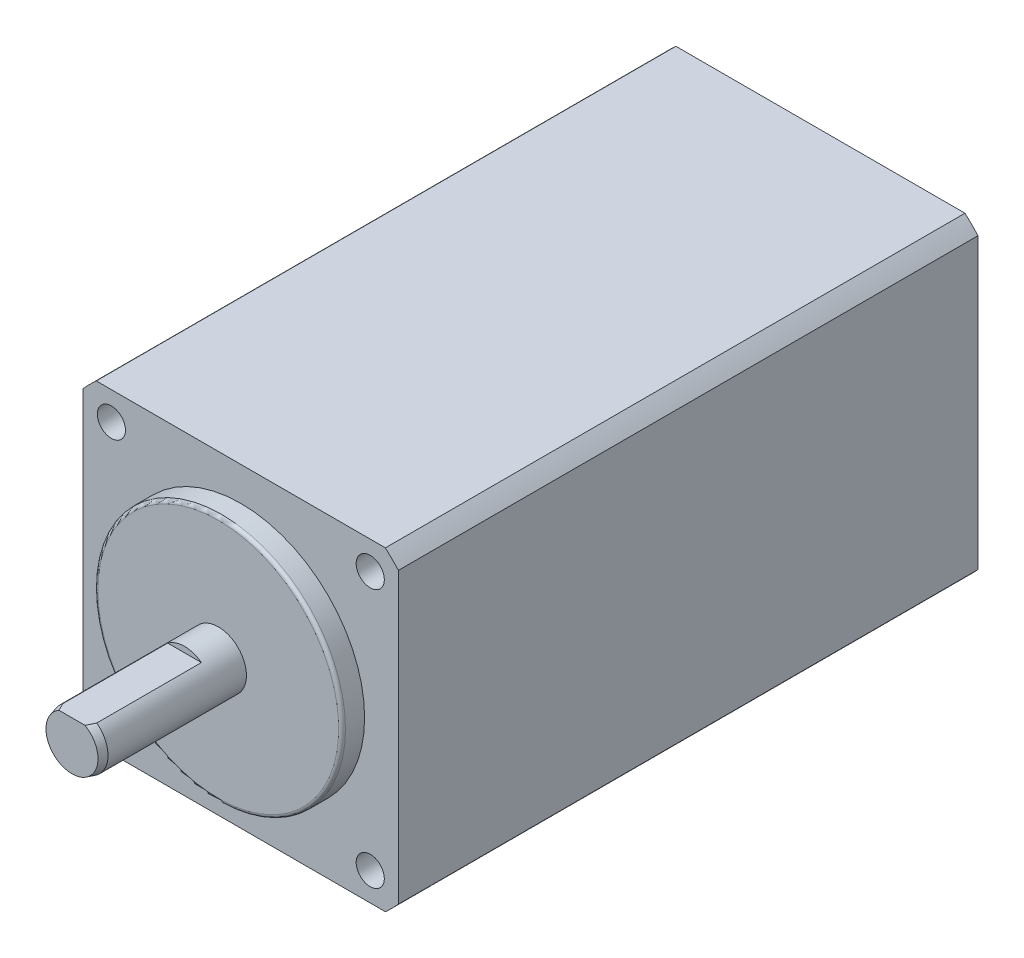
ISO-10303-21;
HEADER;
FILE_DESCRIPTION(('STEP AP214'),'2;1');
FILE_NAME('part.step','',(''),(''),'','','');
FILE_SCHEMA(('AUTOMOTIVE_DESIGN { 1 0 10303 214 1 1 1 1 }'));
ENDSEC;
DATA;
#1=APPLICATION_CONTEXT('core data for automotive mechanical design processes');
#2=APPLICATION_PROTOCOL_DEFINITION('international standard','automotive_design',2000,#1);
#3=PRODUCT_CONTEXT('',#1,'mechanical');
#4=PRODUCT('Part','Part','',(#3));
#5=PRODUCT_RELATED_PRODUCT_CATEGORY('part','',(#4));
#6=PRODUCT_DEFINITION_FORMATION('','',#4);
#7=PRODUCT_DEFINITION_CONTEXT('part definition',#1,'design');
#8=PRODUCT_DEFINITION('design','',#6,#7);
#9=PRODUCT_DEFINITION_SHAPE('','',#8);
#10=(LENGTH_UNIT() NAMED_UNIT(*) SI_UNIT(.MILLI.,.METRE.));
#11=(NAMED_UNIT(*) PLANE_ANGLE_UNIT() SI_UNIT($,.RADIAN.));
#12=(NAMED_UNIT(*) SI_UNIT($,.STERADIAN.) SOLID_ANGLE_UNIT());
#13=UNCERTAINTY_MEASURE_WITH_UNIT(LENGTH_MEASURE(1.E-05),#10,'distance_accuracy_value','');
#14=(GEOMETRIC_REPRESENTATION_CONTEXT(3) GLOBAL_UNCERTAINTY_ASSIGNED_CONTEXT((#13)) GLOBAL_UNIT_ASSIGNED_CONTEXT((#10,
#11,#12)) REPRESENTATION_CONTEXT('',''));
#15=CARTESIAN_POINT('',(0.,0.,0.));
#16=DIRECTION('',(0.,0.,1.));
#17=DIRECTION('',(1.,0.,0.));
#18=AXIS2_PLACEMENT_3D('',#15,#16,#17);
#19=CARTESIAN_POINT('',(-14.,0.,-51.5));
#20=DIRECTION('',(1.,0.,0.));
#21=DIRECTION('',(0.,0.,-1.));
#22=AXIS2_PLACEMENT_3D('',#19,#20,#21);
#23=PLANE('',#22);
#24=DIRECTION('',(0.,1.,0.));
#25=VECTOR('',#24,1.);
#26=CARTESIAN_POINT('',(-14.,0.,0.));
#27=LINE('',#26,#25);
#28=CARTESIAN_POINT('',(-14.,-12.8452325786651,0.));
#29=VERTEX_POINT('',#28);
#30=CARTESIAN_POINT('',(-14.,12.8452325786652,0.));
#31=VERTEX_POINT('',#30);
#32=EDGE_CURVE('E317',#29,#31,#27,.T.);
#33=ORIENTED_EDGE('',*,*,#32,.T.);
#34=DIRECTION('',(0.,0.,1.));
#35=VECTOR('',#34,1.);
#36=CARTESIAN_POINT('',(-14.,12.8452325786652,-51.5));
#37=LINE('',#36,#35);
#38=CARTESIAN_POINT('',(-14.,12.8452325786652,-51.5));
#39=VERTEX_POINT('',#38);
#40=EDGE_CURVE('E221',#39,#31,#37,.T.);
#41=ORIENTED_EDGE('',*,*,#40,.F.);
#42=DIRECTION('',(0.,1.,0.));
#43=VECTOR('',#42,1.);
#44=CARTESIAN_POINT('',(-14.,0.,-51.5));
#45=LINE('',#44,#43);
#46=CARTESIAN_POINT('',(-14.,-12.8452325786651,-51.5));
#47=VERTEX_POINT('',#46);
#48=EDGE_CURVE('E384',#47,#39,#45,.T.);
#49=ORIENTED_EDGE('',*,*,#48,.F.);
#50=DIRECTION('',(0.,0.,1.));
#51=VECTOR('',#50,1.);
#52=CARTESIAN_POINT('',(-14.,-12.8452325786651,-51.5));
#53=LINE('',#52,#51);
#54=EDGE_CURVE('E321',#47,#29,#53,.T.);
#55=ORIENTED_EDGE('',*,*,#54,.T.);
#56=EDGE_LOOP('',(#33,#41,#49,#55));
#57=FACE_BOUND('',#56,.T.);
#58=ADVANCED_FACE('F49',(#57),#23,.F.);
#59=CARTESIAN_POINT('',(0.,0.,-51.5));
#60=DIRECTION('',(0.,0.,1.));
#61=DIRECTION('',(1.,0.,0.));
#62=AXIS2_PLACEMENT_3D('',#59,#60,#61);
#63=CYLINDRICAL_SURFACE('',#62,19.);
#64=CARTESIAN_POINT('',(0.,0.,0.));
#65=DIRECTION('',(0.,0.,-1.));
#66=DIRECTION('',(-1.,0.,0.));
#67=AXIS2_PLACEMENT_3D('',#64,#65,#66);
#68=CIRCLE('',#67,19.);
#69=CARTESIAN_POINT('',(-12.8452325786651,14.,0.));
#70=VERTEX_POINT('',#69);
#71=EDGE_CURVE('E324',#31,#70,#68,.T.);
#72=ORIENTED_EDGE('',*,*,#71,.T.);
#73=DIRECTION('',(0.,0.,1.));
#74=VECTOR('',#73,1.);
#75=CARTESIAN_POINT('',(-12.8452325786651,14.,-51.5));
#76=LINE('',#75,#74);
#77=CARTESIAN_POINT('',(-12.8452325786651,14.,-51.5));
#78=VERTEX_POINT('',#77);
#79=EDGE_CURVE('E358',#78,#70,#76,.T.);
#80=ORIENTED_EDGE('',*,*,#79,.F.);
#81=CARTESIAN_POINT('',(0.,0.,-51.5));
#82=DIRECTION('',(0.,0.,-1.));
#83=DIRECTION('',(-1.,0.,0.));
#84=AXIS2_PLACEMENT_3D('',#81,#82,#83);
#85=CIRCLE('',#84,19.);
#86=EDGE_CURVE('E387',#39,#78,#85,.T.);
#87=ORIENTED_EDGE('',*,*,#86,.F.);
#88=ORIENTED_EDGE('',*,*,#40,.T.);
#89=EDGE_LOOP('',(#72,#80,#87,#88));
#90=FACE_BOUND('',#89,.T.);
#91=ADVANCED_FACE('F294',(#90),#63,.T.);
#92=CARTESIAN_POINT('',(0.,14.,-51.5));
#93=DIRECTION('',(0.,-1.,0.));
#94=DIRECTION('',(0.,0.,-1.));
#95=AXIS2_PLACEMENT_3D('',#92,#93,#94);
#96=PLANE('',#95);
#97=DIRECTION('',(1.,0.,0.));
#98=VECTOR('',#97,1.);
#99=CARTESIAN_POINT('',(0.,14.,0.));
#100=LINE('',#99,#98);
#101=CARTESIAN_POINT('',(12.8452325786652,14.,0.));
#102=VERTEX_POINT('',#101);
#103=EDGE_CURVE('E327',#70,#102,#100,.T.);
#104=ORIENTED_EDGE('',*,*,#103,.T.);
#105=DIRECTION('',(0.,0.,1.));
#106=VECTOR('',#105,1.);
#107=CARTESIAN_POINT('',(12.8452325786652,14.,-51.5));
#108=LINE('',#107,#106);
#109=CARTESIAN_POINT('',(12.8452325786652,14.,-51.5));
#110=VERTEX_POINT('',#109);
#111=EDGE_CURVE('E355',#110,#102,#108,.T.);
#112=ORIENTED_EDGE('',*,*,#111,.F.);
#113=DIRECTION('',(1.,0.,0.));
#114=VECTOR('',#113,1.);
#115=CARTESIAN_POINT('',(0.,14.,-51.5));
#116=LINE('',#115,#114);
#117=EDGE_CURVE('E389',#78,#110,#116,.T.);
#118=ORIENTED_EDGE('',*,*,#117,.F.);
#119=ORIENTED_EDGE('',*,*,#79,.T.);
#120=EDGE_LOOP('',(#104,#112,#118,#119));
#121=FACE_BOUND('',#120,.T.);
#122=ADVANCED_FACE('F304',(#121),#96,.F.);
#123=CARTESIAN_POINT('',(14.,12.8452325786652,0.));
#124=VERTEX_POINT('',#123);
#125=EDGE_CURVE('E330',#102,#124,#68,.T.);
#126=ORIENTED_EDGE('',*,*,#125,.T.);
#127=DIRECTION('',(0.,0.,1.));
#128=VECTOR('',#127,1.);
#129=CARTESIAN_POINT('',(14.,12.8452325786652,-51.5));
#130=LINE('',#129,#128);
#131=CARTESIAN_POINT('',(14.,12.8452325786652,-51.5));
#132=VERTEX_POINT('',#131);
#133=EDGE_CURVE('E353',#132,#124,#130,.T.);
#134=ORIENTED_EDGE('',*,*,#133,.F.);
#135=EDGE_CURVE('E390',#110,#132,#85,.T.);
#136=ORIENTED_EDGE('',*,*,#135,.F.);
#137=ORIENTED_EDGE('',*,*,#111,.T.);
#138=EDGE_LOOP('',(#126,#134,#136,#137));
#139=FACE_BOUND('',#138,.T.);
#140=ADVANCED_FACE('F302',(#139),#63,.T.);
#141=CARTESIAN_POINT('',(14.,0.,-51.5));
#142=DIRECTION('',(1.,0.,0.));
#143=DIRECTION('',(0.,0.,-1.));
#144=AXIS2_PLACEMENT_3D('',#141,#142,#143);
#145=PLANE('',#144);
#146=DIRECTION('',(0.,1.,0.));
#147=VECTOR('',#146,1.);
#148=CARTESIAN_POINT('',(14.,0.,0.));
#149=LINE('',#148,#147);
#150=CARTESIAN_POINT('',(14.,-12.8452325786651,0.));
#151=VERTEX_POINT('',#150);
#152=EDGE_CURVE('E338',#151,#124,#149,.T.);
#153=ORIENTED_EDGE('',*,*,#152,.F.);
#154=DIRECTION('',(0.,0.,1.));
#155=VECTOR('',#154,1.);
#156=CARTESIAN_POINT('',(14.,-12.8452325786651,-51.5));
#157=LINE('',#156,#155);
#158=CARTESIAN_POINT('',(14.,-12.8452325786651,-51.5));
#159=VERTEX_POINT('',#158);
#160=EDGE_CURVE('E351',#159,#151,#157,.T.);
#161=ORIENTED_EDGE('',*,*,#160,.F.);
#162=DIRECTION('',(0.,1.,0.));
#163=VECTOR('',#162,1.);
#164=CARTESIAN_POINT('',(14.,0.,-51.5));
#165=LINE('',#164,#163);
#166=EDGE_CURVE('E391',#159,#132,#165,.T.);
#167=ORIENTED_EDGE('',*,*,#166,.T.);
#168=ORIENTED_EDGE('',*,*,#133,.T.);
#169=EDGE_LOOP('',(#153,#161,#167,#168));
#170=FACE_BOUND('',#169,.T.);
#171=ADVANCED_FACE('F299',(#170),#145,.T.);
#172=CARTESIAN_POINT('',(12.8452325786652,-14.,0.));
#173=VERTEX_POINT('',#172);
#174=EDGE_CURVE('E341',#151,#173,#68,.T.);
#175=ORIENTED_EDGE('',*,*,#174,.T.);
#176=DIRECTION('',(0.,0.,1.));
#177=VECTOR('',#176,1.);
#178=CARTESIAN_POINT('',(12.8452325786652,-14.,-51.5));
#179=LINE('',#178,#177);
#180=CARTESIAN_POINT('',(12.8452325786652,-14.,-51.5));
#181=VERTEX_POINT('',#180);
#182=EDGE_CURVE('E349',#181,#173,#179,.T.);
#183=ORIENTED_EDGE('',*,*,#182,.F.);
#184=EDGE_CURVE('E366',#159,#181,#85,.T.);
#185=ORIENTED_EDGE('',*,*,#184,.F.);
#186=ORIENTED_EDGE('',*,*,#160,.T.);
#187=EDGE_LOOP('',(#175,#183,#185,#186));
#188=FACE_BOUND('',#187,.T.);
#189=ADVANCED_FACE('F295',(#188),#63,.T.);
#190=CARTESIAN_POINT('',(0.,-14.,-51.5));
#191=DIRECTION('',(0.,-1.,0.));
#192=DIRECTION('',(0.,0.,-1.));
#193=AXIS2_PLACEMENT_3D('',#190,#191,#192);
#194=PLANE('',#193);
#195=DIRECTION('',(0.,0.,-1.));
#196=VECTOR('',#195,1.);
#197=CARTESIAN_POINT('',(-7.6,-14.,-51.5));
#198=LINE('',#197,#196);
#199=CARTESIAN_POINT('',(-7.6,-14.,-42.));
#200=VERTEX_POINT('',#199);
#201=CARTESIAN_POINT('',(-7.6,-14.,-51.5));
#202=VERTEX_POINT('',#201);
#203=EDGE_CURVE('E193',#200,#202,#198,.T.);
#204=ORIENTED_EDGE('',*,*,#203,.F.);
#205=DIRECTION('',(-1.,0.,0.));
#206=VECTOR('',#205,1.);
#207=CARTESIAN_POINT('',(-7.6,-14.,-42.));
#208=LINE('',#207,#206);
#209=CARTESIAN_POINT('',(7.6,-14.,-42.));
#210=VERTEX_POINT('',#209);
#211=EDGE_CURVE('E200',#210,#200,#208,.T.);
#212=ORIENTED_EDGE('',*,*,#211,.F.);
#213=DIRECTION('',(0.,0.,1.));
#214=VECTOR('',#213,1.);
#215=CARTESIAN_POINT('',(7.6,-14.,-51.5));
#216=LINE('',#215,#214);
#217=CARTESIAN_POINT('',(7.6,-14.,-51.5));
#218=VERTEX_POINT('',#217);
#219=EDGE_CURVE('E214',#218,#210,#216,.T.);
#220=ORIENTED_EDGE('',*,*,#219,.F.);
#221=DIRECTION('',(1.,0.,0.));
#222=VECTOR('',#221,1.);
#223=CARTESIAN_POINT('',(0.,-14.,-51.5));
#224=LINE('',#223,#222);
#225=EDGE_CURVE('E364',#218,#181,#224,.T.);
#226=ORIENTED_EDGE('',*,*,#225,.T.);
#227=ORIENTED_EDGE('',*,*,#182,.T.);
#228=DIRECTION('',(1.,0.,0.));
#229=VECTOR('',#228,1.);
#230=CARTESIAN_POINT('',(0.,-14.,0.));
#231=LINE('',#230,#229);
#232=CARTESIAN_POINT('',(-12.8452325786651,-14.,0.));
#233=VERTEX_POINT('',#232);
#234=EDGE_CURVE('E342',#233,#173,#231,.T.);
#235=ORIENTED_EDGE('',*,*,#234,.F.);
#236=DIRECTION('',(0.,0.,1.));
#237=VECTOR('',#236,1.);
#238=CARTESIAN_POINT('',(-12.8452325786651,-14.,-51.5));
#239=LINE('',#238,#237);
#240=CARTESIAN_POINT('',(-12.8452325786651,-14.,-51.5));
#241=VERTEX_POINT('',#240);
#242=EDGE_CURVE('E346',#241,#233,#239,.T.);
#243=ORIENTED_EDGE('',*,*,#242,.F.);
#244=EDGE_CURVE('E362',#241,#202,#224,.T.);
#245=ORIENTED_EDGE('',*,*,#244,.T.);
#246=EDGE_LOOP('',(#204,#212,#220,#226,#227,#235,#243,#245));
#247=FACE_BOUND('',#246,.T.);
#248=ADVANCED_FACE('F292',(#247),#194,.T.);
#249=EDGE_CURVE('E329',#233,#29,#68,.T.);
#250=ORIENTED_EDGE('',*,*,#249,.T.);
#251=ORIENTED_EDGE('',*,*,#54,.F.);
#252=EDGE_CURVE('E347',#241,#47,#85,.T.);
#253=ORIENTED_EDGE('',*,*,#252,.F.);
#254=ORIENTED_EDGE('',*,*,#242,.T.);
#255=EDGE_LOOP('',(#250,#251,#253,#254));
#256=FACE_BOUND('',#255,.T.);
#257=ADVANCED_FACE('F286',(#256),#63,.T.);
#258=CARTESIAN_POINT('',(0.,0.,-51.5));
#259=DIRECTION('',(0.,0.,-1.));
#260=DIRECTION('',(-1.,0.,0.));
#261=AXIS2_PLACEMENT_3D('',#258,#259,#260);
#262=PLANE('',#261);
#263=DIRECTION('',(-1.,0.,0.));
#264=VECTOR('',#263,1.);
#265=CARTESIAN_POINT('',(0.,2.,-51.5));
#266=LINE('',#265,#264);
#267=CARTESIAN_POINT('',(1.5,2.,-51.5));
#268=VERTEX_POINT('',#267);
#269=CARTESIAN_POINT('',(-1.5,2.,-51.5));
#270=VERTEX_POINT('',#269);
#271=EDGE_CURVE('E156',#268,#270,#266,.T.);
#272=ORIENTED_EDGE('',*,*,#271,.T.);
#273=CARTESIAN_POINT('',(0.,0.,-51.5));
#274=DIRECTION('',(0.,0.,-1.));
#275=DIRECTION('',(-1.,0.,0.));
#276=AXIS2_PLACEMENT_3D('',#273,#274,#275);
#277=CIRCLE('',#276,2.5);
#278=EDGE_CURVE('E161',#268,#270,#277,.T.);
#279=ORIENTED_EDGE('',*,*,#278,.F.);
#280=EDGE_LOOP('',(#272,#279));
#281=FACE_BOUND('',#280,.T.);
#282=ORIENTED_EDGE('',*,*,#48,.T.);
#283=ORIENTED_EDGE('',*,*,#86,.T.);
#284=ORIENTED_EDGE('',*,*,#117,.T.);
#285=ORIENTED_EDGE('',*,*,#135,.T.);
#286=ORIENTED_EDGE('',*,*,#166,.F.);
#287=ORIENTED_EDGE('',*,*,#184,.T.);
#288=ORIENTED_EDGE('',*,*,#225,.F.);
#289=DIRECTION('',(0.,1.,0.));
#290=VECTOR('',#289,1.);
#291=CARTESIAN_POINT('',(7.6,-19.,-51.5));
#292=LINE('',#291,#290);
#293=CARTESIAN_POINT('',(7.6,-19.,-51.5));
#294=VERTEX_POINT('',#293);
#295=EDGE_CURVE('E332',#294,#218,#292,.T.);
#296=ORIENTED_EDGE('',*,*,#295,.F.);
#297=DIRECTION('',(1.,0.,0.));
#298=VECTOR('',#297,1.);
#299=CARTESIAN_POINT('',(-7.6,-19.,-51.5));
#300=LINE('',#299,#298);
#301=CARTESIAN_POINT('',(-7.6,-19.,-51.5));
#302=VERTEX_POINT('',#301);
#303=EDGE_CURVE('E199',#302,#294,#300,.T.);
#304=ORIENTED_EDGE('',*,*,#303,.F.);
#305=DIRECTION('',(0.,1.,0.));
#306=VECTOR('',#305,1.);
#307=CARTESIAN_POINT('',(-7.6,-19.,-51.5));
#308=LINE('',#307,#306);
#309=EDGE_CURVE('E325',#302,#202,#308,.T.);
#310=ORIENTED_EDGE('',*,*,#309,.T.);
#311=ORIENTED_EDGE('',*,*,#244,.F.);
#312=ORIENTED_EDGE('',*,*,#252,.T.);
#313=EDGE_LOOP('',(#282,#283,#284,#285,#286,#287,#288,#296,#304,#310,#311,#312));
#314=FACE_BOUND('',#313,.T.);
#315=ADVANCED_FACE('F165',(#281,#314),#262,.T.);
#316=CARTESIAN_POINT('',(0.,0.,0.));
#317=DIRECTION('',(0.,0.,-1.));
#318=DIRECTION('',(-1.,0.,0.));
#319=AXIS2_PLACEMENT_3D('',#316,#317,#318);
#320=PLANE('',#319);
#321=CARTESIAN_POINT('',(11.5,-11.5,0.));
#322=DIRECTION('',(0.,0.,1.));
#323=DIRECTION('',(1.,0.,0.));
#324=AXIS2_PLACEMENT_3D('',#321,#322,#323);
#325=CIRCLE('',#324,1.25);
#326=CARTESIAN_POINT('',(12.75,-11.5,0.));
#327=VERTEX_POINT('',#326);
#328=EDGE_CURVE('E171',#327,#327,#325,.T.);
#329=ORIENTED_EDGE('',*,*,#328,.F.);
#330=EDGE_LOOP('',(#329));
#331=FACE_BOUND('',#330,.T.);
#332=CARTESIAN_POINT('',(-11.5,-11.5,0.));
#333=DIRECTION('',(0.,0.,1.));
#334=DIRECTION('',(1.,0.,0.));
#335=AXIS2_PLACEMENT_3D('',#332,#333,#334);
#336=CIRCLE('',#335,1.25);
#337=CARTESIAN_POINT('',(-10.25,-11.5,0.));
#338=VERTEX_POINT('',#337);
#339=EDGE_CURVE('E175',#338,#338,#336,.T.);
#340=ORIENTED_EDGE('',*,*,#339,.F.);
#341=EDGE_LOOP('',(#340));
#342=FACE_BOUND('',#341,.T.);
#343=CARTESIAN_POINT('',(11.5,11.5,0.));
#344=DIRECTION('',(0.,0.,1.));
#345=DIRECTION('',(1.,0.,0.));
#346=AXIS2_PLACEMENT_3D('',#343,#344,#345);
#347=CIRCLE('',#346,1.25);
#348=CARTESIAN_POINT('',(12.75,11.5,0.));
#349=VERTEX_POINT('',#348);
#350=EDGE_CURVE('E181',#349,#349,#347,.T.);
#351=ORIENTED_EDGE('',*,*,#350,.F.);
#352=EDGE_LOOP('',(#351));
#353=FACE_BOUND('',#352,.T.);
#354=CARTESIAN_POINT('',(-11.5,11.5,0.));
#355=DIRECTION('',(0.,0.,1.));
#356=DIRECTION('',(1.,0.,0.));
#357=AXIS2_PLACEMENT_3D('',#354,#355,#356);
#358=CIRCLE('',#357,1.25);
#359=CARTESIAN_POINT('',(-10.25,11.5,0.));
#360=VERTEX_POINT('',#359);
#361=EDGE_CURVE('E187',#360,#360,#358,.T.);
#362=ORIENTED_EDGE('',*,*,#361,.F.);
#363=EDGE_LOOP('',(#362));
#364=FACE_BOUND('',#363,.T.);
#365=ORIENTED_EDGE('',*,*,#32,.F.);
#366=ORIENTED_EDGE('',*,*,#249,.F.);
#367=ORIENTED_EDGE('',*,*,#234,.T.);
#368=ORIENTED_EDGE('',*,*,#174,.F.);
#369=ORIENTED_EDGE('',*,*,#152,.T.);
#370=ORIENTED_EDGE('',*,*,#125,.F.);
#371=ORIENTED_EDGE('',*,*,#103,.F.);
#372=ORIENTED_EDGE('',*,*,#71,.F.);
#373=EDGE_LOOP('',(#365,#366,#367,#368,#369,#370,#371,#372));
#374=FACE_BOUND('',#373,.T.);
#375=ADVANCED_FACE('F282',(#331,#342,#353,#364,#374),#320,.F.);
#376=CARTESIAN_POINT('',(-7.6,-19.,-51.5));
#377=DIRECTION('',(1.,0.,0.));
#378=DIRECTION('',(0.,0.,-1.));
#379=AXIS2_PLACEMENT_3D('',#376,#377,#378);
#380=PLANE('',#379);
#381=ORIENTED_EDGE('',*,*,#203,.T.);
#382=ORIENTED_EDGE('',*,*,#309,.F.);
#383=DIRECTION('',(0.,0.,-1.));
#384=VECTOR('',#383,1.);
#385=CARTESIAN_POINT('',(-7.6,-19.,-51.5));
#386=LINE('',#385,#384);
#387=CARTESIAN_POINT('',(-7.6,-19.,-42.));
#388=VERTEX_POINT('',#387);
#389=EDGE_CURVE('E196',#388,#302,#386,.T.);
#390=ORIENTED_EDGE('',*,*,#389,.F.);
#391=DIRECTION('',(0.,1.,0.));
#392=VECTOR('',#391,1.);
#393=CARTESIAN_POINT('',(-7.6,-19.,-42.));
#394=LINE('',#393,#392);
#395=EDGE_CURVE('E206',#388,#200,#394,.T.);
#396=ORIENTED_EDGE('',*,*,#395,.T.);
#397=EDGE_LOOP('',(#381,#382,#390,#396));
#398=FACE_BOUND('',#397,.T.);
#399=ADVANCED_FACE('F278',(#398),#380,.F.);
#400=CARTESIAN_POINT('',(7.6,-19.,-51.5));
#401=DIRECTION('',(-1.,0.,0.));
#402=DIRECTION('',(0.,0.,1.));
#403=AXIS2_PLACEMENT_3D('',#400,#401,#402);
#404=PLANE('',#403);
#405=ORIENTED_EDGE('',*,*,#219,.T.);
#406=DIRECTION('',(0.,1.,0.));
#407=VECTOR('',#406,1.);
#408=CARTESIAN_POINT('',(7.6,-19.,-42.));
#409=LINE('',#408,#407);
#410=CARTESIAN_POINT('',(7.6,-19.,-42.));
#411=VERTEX_POINT('',#410);
#412=EDGE_CURVE('E373',#411,#210,#409,.T.);
#413=ORIENTED_EDGE('',*,*,#412,.F.);
#414=DIRECTION('',(0.,0.,1.));
#415=VECTOR('',#414,1.);
#416=CARTESIAN_POINT('',(7.6,-19.,-51.5));
#417=LINE('',#416,#415);
#418=EDGE_CURVE('E202',#294,#411,#417,.T.);
#419=ORIENTED_EDGE('',*,*,#418,.F.);
#420=ORIENTED_EDGE('',*,*,#295,.T.);
#421=EDGE_LOOP('',(#405,#413,#419,#420));
#422=FACE_BOUND('',#421,.T.);
#423=ADVANCED_FACE('F274',(#422),#404,.F.);
#424=CARTESIAN_POINT('',(-7.6,-19.,-42.));
#425=DIRECTION('',(0.,0.,-1.));
#426=DIRECTION('',(-1.,0.,0.));
#427=AXIS2_PLACEMENT_3D('',#424,#425,#426);
#428=PLANE('',#427);
#429=ORIENTED_EDGE('',*,*,#211,.T.);
#430=ORIENTED_EDGE('',*,*,#395,.F.);
#431=DIRECTION('',(-1.,0.,0.));
#432=VECTOR('',#431,1.);
#433=CARTESIAN_POINT('',(-7.6,-19.,-42.));
#434=LINE('',#433,#432);
#435=EDGE_CURVE('E204',#411,#388,#434,.T.);
#436=ORIENTED_EDGE('',*,*,#435,.F.);
#437=ORIENTED_EDGE('',*,*,#412,.T.);
#438=EDGE_LOOP('',(#429,#430,#436,#437));
#439=FACE_BOUND('',#438,.T.);
#440=ADVANCED_FACE('F270',(#439),#428,.F.);
#441=CARTESIAN_POINT('',(0.,-19.,0.));
#442=DIRECTION('',(0.,1.,0.));
#443=DIRECTION('',(0.,0.,1.));
#444=AXIS2_PLACEMENT_3D('',#441,#442,#443);
#445=PLANE('',#444);
#446=ORIENTED_EDGE('',*,*,#389,.T.);
#447=ORIENTED_EDGE('',*,*,#303,.T.);
#448=ORIENTED_EDGE('',*,*,#418,.T.);
#449=ORIENTED_EDGE('',*,*,#435,.T.);
#450=EDGE_LOOP('',(#446,#447,#448,#449));
#451=FACE_BOUND('',#450,.T.);
#452=ADVANCED_FACE('F266',(#451),#445,.F.);
#453=CARTESIAN_POINT('',(-11.5,11.5,-4.5));
#454=DIRECTION('',(0.,0.,1.));
#455=DIRECTION('',(1.,0.,0.));
#456=AXIS2_PLACEMENT_3D('',#453,#454,#455);
#457=CYLINDRICAL_SURFACE('',#456,1.25);
#458=CARTESIAN_POINT('',(-11.5,11.5,-4.5));
#459=DIRECTION('',(0.,0.,1.));
#460=DIRECTION('',(1.,0.,0.));
#461=AXIS2_PLACEMENT_3D('',#458,#459,#460);
#462=CIRCLE('',#461,1.25);
#463=CARTESIAN_POINT('',(-10.25,11.5,-4.5));
#464=VERTEX_POINT('',#463);
#465=EDGE_CURVE('E190',#464,#464,#462,.T.);
#466=ORIENTED_EDGE('',*,*,#465,.F.);
#467=EDGE_LOOP('',(#466));
#468=FACE_BOUND('',#467,.T.);
#469=ORIENTED_EDGE('',*,*,#361,.T.);
#470=EDGE_LOOP('',(#469));
#471=FACE_BOUND('',#470,.T.);
#472=ADVANCED_FACE('F262',(#468,#471),#457,.F.);
#473=CARTESIAN_POINT('',(-11.5,11.5,-4.5));
#474=DIRECTION('',(0.,0.,1.));
#475=DIRECTION('',(1.,0.,0.));
#476=AXIS2_PLACEMENT_3D('',#473,#474,#475);
#477=PLANE('',#476);
#478=ORIENTED_EDGE('',*,*,#465,.T.);
#479=EDGE_LOOP('',(#478));
#480=FACE_BOUND('',#479,.T.);
#481=ADVANCED_FACE('F258',(#480),#477,.T.);
#482=CARTESIAN_POINT('',(11.5,11.5,-4.5));
#483=DIRECTION('',(0.,0.,1.));
#484=DIRECTION('',(1.,0.,0.));
#485=AXIS2_PLACEMENT_3D('',#482,#483,#484);
#486=CYLINDRICAL_SURFACE('',#485,1.25);
#487=CARTESIAN_POINT('',(11.5,11.5,-4.5));
#488=DIRECTION('',(0.,0.,1.));
#489=DIRECTION('',(1.,0.,0.));
#490=AXIS2_PLACEMENT_3D('',#487,#488,#489);
#491=CIRCLE('',#490,1.25);
#492=CARTESIAN_POINT('',(12.75,11.5,-4.5));
#493=VERTEX_POINT('',#492);
#494=EDGE_CURVE('E184',#493,#493,#491,.T.);
#495=ORIENTED_EDGE('',*,*,#494,.F.);
#496=EDGE_LOOP('',(#495));
#497=FACE_BOUND('',#496,.T.);
#498=ORIENTED_EDGE('',*,*,#350,.T.);
#499=EDGE_LOOP('',(#498));
#500=FACE_BOUND('',#499,.T.);
#501=ADVANCED_FACE('F254',(#497,#500),#486,.F.);
#502=CARTESIAN_POINT('',(11.5,11.5,-4.5));
#503=DIRECTION('',(0.,0.,1.));
#504=DIRECTION('',(1.,0.,0.));
#505=AXIS2_PLACEMENT_3D('',#502,#503,#504);
#506=PLANE('',#505);
#507=ORIENTED_EDGE('',*,*,#494,.T.);
#508=EDGE_LOOP('',(#507));
#509=FACE_BOUND('',#508,.T.);
#510=ADVANCED_FACE('F250',(#509),#506,.T.);
#511=CARTESIAN_POINT('',(-11.5,-11.5,-4.5));
#512=DIRECTION('',(0.,0.,1.));
#513=DIRECTION('',(1.,0.,0.));
#514=AXIS2_PLACEMENT_3D('',#511,#512,#513);
#515=CYLINDRICAL_SURFACE('',#514,1.25);
#516=CARTESIAN_POINT('',(-11.5,-11.5,-4.5));
#517=DIRECTION('',(0.,0.,1.));
#518=DIRECTION('',(1.,0.,0.));
#519=AXIS2_PLACEMENT_3D('',#516,#517,#518);
#520=CIRCLE('',#519,1.25);
#521=CARTESIAN_POINT('',(-10.25,-11.5,-4.5));
#522=VERTEX_POINT('',#521);
#523=EDGE_CURVE('E178',#522,#522,#520,.T.);
#524=ORIENTED_EDGE('',*,*,#523,.F.);
#525=EDGE_LOOP('',(#524));
#526=FACE_BOUND('',#525,.T.);
#527=ORIENTED_EDGE('',*,*,#339,.T.);
#528=EDGE_LOOP('',(#527));
#529=FACE_BOUND('',#528,.T.);
#530=ADVANCED_FACE('F246',(#526,#529),#515,.F.);
#531=CARTESIAN_POINT('',(-11.5,-11.5,-4.5));
#532=DIRECTION('',(0.,0.,1.));
#533=DIRECTION('',(1.,0.,0.));
#534=AXIS2_PLACEMENT_3D('',#531,#532,#533);
#535=PLANE('',#534);
#536=ORIENTED_EDGE('',*,*,#523,.T.);
#537=EDGE_LOOP('',(#536));
#538=FACE_BOUND('',#537,.T.);
#539=ADVANCED_FACE('F242',(#538),#535,.T.);
#540=CARTESIAN_POINT('',(11.5,-11.5,-4.5));
#541=DIRECTION('',(0.,0.,1.));
#542=DIRECTION('',(1.,0.,0.));
#543=AXIS2_PLACEMENT_3D('',#540,#541,#542);
#544=CYLINDRICAL_SURFACE('',#543,1.25);
#545=CARTESIAN_POINT('',(11.5,-11.5,-4.5));
#546=DIRECTION('',(0.,0.,1.));
#547=DIRECTION('',(1.,0.,0.));
#548=AXIS2_PLACEMENT_3D('',#545,#546,#547);
#549=CIRCLE('',#548,1.25);
#550=CARTESIAN_POINT('',(12.75,-11.5,-4.5));
#551=VERTEX_POINT('',#550);
#552=EDGE_CURVE('E172',#551,#551,#549,.T.);
#553=ORIENTED_EDGE('',*,*,#552,.F.);
#554=EDGE_LOOP('',(#553));
#555=FACE_BOUND('',#554,.T.);
#556=ORIENTED_EDGE('',*,*,#328,.T.);
#557=EDGE_LOOP('',(#556));
#558=FACE_BOUND('',#557,.T.);
#559=ADVANCED_FACE('F238',(#555,#558),#544,.F.);
#560=CARTESIAN_POINT('',(11.5,-11.5,-4.5));
#561=DIRECTION('',(0.,0.,1.));
#562=DIRECTION('',(1.,0.,0.));
#563=AXIS2_PLACEMENT_3D('',#560,#561,#562);
#564=PLANE('',#563);
#565=ORIENTED_EDGE('',*,*,#552,.T.);
#566=EDGE_LOOP('',(#565));
#567=FACE_BOUND('',#566,.T.);
#568=ADVANCED_FACE('F233',(#567),#564,.T.);
#569=CARTESIAN_POINT('',(0.,2.,-61.5));
#570=DIRECTION('',(0.,1.,0.));
#571=DIRECTION('',(0.,0.,1.));
#572=AXIS2_PLACEMENT_3D('',#569,#570,#571);
#573=PLANE('',#572);
#574=DIRECTION('',(-1.,0.,0.));
#575=VECTOR('',#574,1.);
#576=CARTESIAN_POINT('',(0.,2.,-61.5));
#577=LINE('',#576,#575);
#578=CARTESIAN_POINT('',(1.16075761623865,2.,-61.5));
#579=VERTEX_POINT('',#578);
#580=CARTESIAN_POINT('',(-1.16075761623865,2.,-61.5));
#581=VERTEX_POINT('',#580);
#582=EDGE_CURVE('E159',#579,#581,#577,.T.);
#583=ORIENTED_EDGE('',*,*,#582,.T.);
#584=CARTESIAN_POINT('',(-1.16075761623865,2.,-61.5));
#585=CARTESIAN_POINT('',(-1.19128641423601,2.,-61.4427849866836));
#586=CARTESIAN_POINT('',(-1.22113150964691,2.,-61.3852109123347));
#587=CARTESIAN_POINT('',(-1.27963273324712,2.,-61.2694828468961));
#588=CARTESIAN_POINT('',(-1.30828921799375,2.,-61.211329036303));
#589=CARTESIAN_POINT('',(-1.36460851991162,2.,-61.0945478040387));
#590=CARTESIAN_POINT('',(-1.39227138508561,2.,-61.035920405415));
#591=CARTESIAN_POINT('',(-1.44674461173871,2.,-60.9182490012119));
#592=CARTESIAN_POINT('',(-1.47355471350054,2.,-60.859204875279));
#593=CARTESIAN_POINT('',(-1.5,2.,-60.7999999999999));
#594=B_SPLINE_CURVE_WITH_KNOTS('',3,(#584,#585,#586,#587,#588,#589,#590,#591,#592,#593),
.UNSPECIFIED.,.F.,.F.,(4,2,2,2,4),(0.,0.19453910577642,0.389019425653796,0.583490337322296,
0.778019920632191),.UNSPECIFIED.);
#595=CARTESIAN_POINT('',(-1.5,2.,-60.7999999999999));
#596=VERTEX_POINT('',#595);
#597=EDGE_CURVE('E58',#581,#596,#594,.T.);
#598=ORIENTED_EDGE('',*,*,#597,.T.);
#599=DIRECTION('',(0.,0.,1.));
#600=VECTOR('',#599,1.);
#601=CARTESIAN_POINT('',(-1.5,2.,-61.5));
#602=LINE('',#601,#600);
#603=EDGE_CURVE('E152',#596,#270,#602,.T.);
#604=ORIENTED_EDGE('',*,*,#603,.T.);
#605=ORIENTED_EDGE('',*,*,#271,.F.);
#606=DIRECTION('',(0.,0.,1.));
#607=VECTOR('',#606,1.);
#608=CARTESIAN_POINT('',(1.5,2.,-61.5));
#609=LINE('',#608,#607);
#610=CARTESIAN_POINT('',(1.5,2.,-60.7999999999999));
#611=VERTEX_POINT('',#610);
#612=EDGE_CURVE('E158',#611,#268,#609,.T.);
#613=ORIENTED_EDGE('',*,*,#612,.F.);
#614=CARTESIAN_POINT('',(1.5,2.,-60.7999999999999));
#615=CARTESIAN_POINT('',(1.47355471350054,2.,-60.859204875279));
#616=CARTESIAN_POINT('',(1.44674461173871,2.,-60.9182490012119));
#617=CARTESIAN_POINT('',(1.39227138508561,2.,-61.035920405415));
#618=CARTESIAN_POINT('',(1.36460851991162,2.,-61.0945478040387));
#619=CARTESIAN_POINT('',(1.30828921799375,2.,-61.211329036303));
#620=CARTESIAN_POINT('',(1.27963273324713,2.,-61.2694828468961));
#621=CARTESIAN_POINT('',(1.22113150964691,2.,-61.3852109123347));
#622=CARTESIAN_POINT('',(1.19128641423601,2.,-61.4427849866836));
#623=CARTESIAN_POINT('',(1.16075761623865,2.,-61.5));
#624=B_SPLINE_CURVE_WITH_KNOTS('',3,(#614,#615,#616,#617,#618,#619,#620,#621,#622,#623),
.UNSPECIFIED.,.F.,.F.,(4,2,2,2,4),(0.,0.194529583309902,0.389000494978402,0.583480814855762,
0.778019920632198),.UNSPECIFIED.);
#625=EDGE_CURVE('E220',#611,#579,#624,.T.);
#626=ORIENTED_EDGE('',*,*,#625,.T.);
#627=EDGE_LOOP('',(#583,#598,#604,#605,#613,#626));
#628=FACE_BOUND('',#627,.T.);
#629=ADVANCED_FACE('F154',(#628),#573,.T.);
#630=CARTESIAN_POINT('',(0.,0.,-61.5));
#631=DIRECTION('',(0.,0.,1.));
#632=DIRECTION('',(1.,0.,0.));
#633=AXIS2_PLACEMENT_3D('',#630,#631,#632);
#634=CYLINDRICAL_SURFACE('',#633,2.5);
#635=ORIENTED_EDGE('',*,*,#603,.F.);
#636=CARTESIAN_POINT('',(0.,0.,-60.7999999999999));
#637=DIRECTION('',(0.,0.,-1.));
#638=DIRECTION('',(-1.,0.,0.));
#639=AXIS2_PLACEMENT_3D('',#636,#637,#638);
#640=CIRCLE('',#639,2.5);
#641=EDGE_CURVE('E12',#596,#611,#640,.F.);
#642=ORIENTED_EDGE('',*,*,#641,.T.);
#643=ORIENTED_EDGE('',*,*,#612,.T.);
#644=ORIENTED_EDGE('',*,*,#278,.T.);
#645=EDGE_LOOP('',(#635,#642,#643,#644));
#646=FACE_BOUND('',#645,.T.);
#647=ADVANCED_FACE('F162',(#646),#634,.T.);
#648=CARTESIAN_POINT('',(0.,0.,-61.5));
#649=DIRECTION('',(0.,0.,-1.));
#650=DIRECTION('',(-1.,0.,0.));
#651=AXIS2_PLACEMENT_3D('',#648,#649,#650);
#652=PLANE('',#651);
#653=ORIENTED_EDGE('',*,*,#582,.F.);
#654=CARTESIAN_POINT('',(0.,0.,-61.5));
#655=DIRECTION('',(0.,0.,-1.));
#656=DIRECTION('',(-1.,0.,0.));
#657=AXIS2_PLACEMENT_3D('',#654,#655,#656);
#658=CIRCLE('',#657,2.31243556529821);
#659=EDGE_CURVE('E217',#579,#581,#658,.T.);
#660=ORIENTED_EDGE('',*,*,#659,.T.);
#661=EDGE_LOOP('',(#653,#660));
#662=FACE_BOUND('',#661,.T.);
#663=ADVANCED_FACE('F543',(#662),#652,.T.);
#664=CARTESIAN_POINT('',(0.,0.,-61.5));
#665=DIRECTION('',(0.,0.,1.));
#666=DIRECTION('',(1.,0.,0.));
#667=AXIS2_PLACEMENT_3D('',#664,#665,#666);
#668=CONICAL_SURFACE('',#667,2.31243556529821,0.261799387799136);
#669=ORIENTED_EDGE('',*,*,#625,.F.);
#670=ORIENTED_EDGE('',*,*,#641,.F.);
#671=ORIENTED_EDGE('',*,*,#597,.F.);
#672=ORIENTED_EDGE('',*,*,#659,.F.);
#673=EDGE_LOOP('',(#669,#670,#671,#672));
#674=FACE_BOUND('',#673,.T.);
#675=ADVANCED_FACE('F51',(#674),#668,.T.);
#676=CLOSED_SHELL('',(#58,#91,#122,#140,#171,#189,#248,#257,#315,#375,#399,#423,#440,#452,#472,
#481,#501,#510,#530,#539,#559,#568,#629,#647,#663,#675));
#677=MANIFOLD_SOLID_BREP('B2',#676);
#678=CARTESIAN_POINT('',(0.,0.,15.));
#679=DIRECTION('',(0.,0.,-1.));
#680=DIRECTION('',(-1.,0.,0.));
#681=AXIS2_PLACEMENT_3D('',#678,#679,#680);
#682=CYLINDRICAL_SURFACE('',#681,2.5);
#683=DIRECTION('',(0.,0.,-1.));
#684=VECTOR('',#683,1.);
#685=CARTESIAN_POINT('',(1.5,2.,15.));
#686=LINE('',#685,#684);
#687=CARTESIAN_POINT('',(1.5,2.,5.));
#688=VERTEX_POINT('',#687);
#689=CARTESIAN_POINT('',(1.5,2.,14.3));
#690=VERTEX_POINT('',#689);
#691=EDGE_CURVE('E644',#688,#690,#686,.F.);
#692=ORIENTED_EDGE('',*,*,#691,.T.);
#693=CARTESIAN_POINT('',(0.,0.,14.3));
#694=DIRECTION('',(0.,0.,1.));
#695=DIRECTION('',(1.,0.,0.));
#696=AXIS2_PLACEMENT_3D('',#693,#694,#695);
#697=CIRCLE('',#696,2.5);
#698=CARTESIAN_POINT('',(-1.5,2.,14.3));
#699=VERTEX_POINT('',#698);
#700=EDGE_CURVE('E619',#690,#699,#697,.F.);
#701=ORIENTED_EDGE('',*,*,#700,.T.);
#702=DIRECTION('',(0.,0.,-1.));
#703=VECTOR('',#702,1.);
#704=CARTESIAN_POINT('',(-1.5,2.,15.));
#705=LINE('',#704,#703);
#706=CARTESIAN_POINT('',(-1.5,2.,5.));
#707=VERTEX_POINT('',#706);
#708=EDGE_CURVE('E637',#699,#707,#705,.T.);
#709=ORIENTED_EDGE('',*,*,#708,.T.);
#710=CARTESIAN_POINT('',(0.,0.,5.));
#711=DIRECTION('',(0.,0.,1.));
#712=DIRECTION('',(1.,0.,0.));
#713=AXIS2_PLACEMENT_3D('',#710,#711,#712);
#714=CIRCLE('',#713,2.5);
#715=EDGE_CURVE('E640',#688,#707,#714,.T.);
#716=ORIENTED_EDGE('',*,*,#715,.F.);
#717=EDGE_LOOP('',(#692,#701,#709,#716));
#718=FACE_BOUND('',#717,.T.);
#719=CARTESIAN_POINT('',(0.,0.,2.));
#720=DIRECTION('',(0.,0.,-1.));
#721=DIRECTION('',(-1.,0.,0.));
#722=AXIS2_PLACEMENT_3D('',#719,#720,#721);
#723=CIRCLE('',#722,2.5);
#724=CARTESIAN_POINT('',(-2.5,0.,2.));
#725=VERTEX_POINT('',#724);
#726=EDGE_CURVE('E659',#725,#725,#723,.T.);
#727=ORIENTED_EDGE('',*,*,#726,.F.);
#728=EDGE_LOOP('',(#727));
#729=FACE_BOUND('',#728,.T.);
#730=ADVANCED_FACE('F604',(#718,#729),#682,.T.);
#731=CARTESIAN_POINT('',(0.,0.,15.));
#732=DIRECTION('',(0.,0.,1.));
#733=DIRECTION('',(1.,0.,0.));
#734=AXIS2_PLACEMENT_3D('',#731,#732,#733);
#735=PLANE('',#734);
#736=DIRECTION('',(1.,0.,0.));
#737=VECTOR('',#736,1.);
#738=CARTESIAN_POINT('',(0.,2.,15.));
#739=LINE('',#738,#737);
#740=CARTESIAN_POINT('',(-1.16075761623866,2.,15.));
#741=VERTEX_POINT('',#740);
#742=CARTESIAN_POINT('',(1.16075761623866,2.,15.));
#743=VERTEX_POINT('',#742);
#744=EDGE_CURVE('E651',#741,#743,#739,.T.);
#745=ORIENTED_EDGE('',*,*,#744,.F.);
#746=CARTESIAN_POINT('',(0.,0.,15.));
#747=DIRECTION('',(0.,0.,1.));
#748=DIRECTION('',(1.,0.,0.));
#749=AXIS2_PLACEMENT_3D('',#746,#747,#748);
#750=CIRCLE('',#749,2.31243556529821);
#751=EDGE_CURVE('E650',#741,#743,#750,.T.);
#752=ORIENTED_EDGE('',*,*,#751,.T.);
#753=EDGE_LOOP('',(#745,#752));
#754=FACE_BOUND('',#753,.T.);
#755=ADVANCED_FACE('F687',(#754),#735,.T.);
#756=CARTESIAN_POINT('',(0.,0.,2.));
#757=DIRECTION('',(0.,0.,-1.));
#758=DIRECTION('',(-1.,0.,0.));
#759=AXIS2_PLACEMENT_3D('',#756,#757,#758);
#760=PLANE('',#759);
#761=CARTESIAN_POINT('',(0.,0.,2.));
#762=DIRECTION('',(0.,0.,-1.));
#763=DIRECTION('',(-1.,0.,0.));
#764=AXIS2_PLACEMENT_3D('',#761,#762,#763);
#765=CIRCLE('',#764,10.7);
#766=CARTESIAN_POINT('',(-10.7,0.,2.));
#767=VERTEX_POINT('',#766);
#768=EDGE_CURVE('E47',#767,#767,#765,.F.);
#769=ORIENTED_EDGE('',*,*,#768,.T.);
#770=EDGE_LOOP('',(#769));
#771=FACE_BOUND('',#770,.T.);
#772=ORIENTED_EDGE('',*,*,#726,.T.);
#773=EDGE_LOOP('',(#772));
#774=FACE_BOUND('',#773,.T.);
#775=ADVANCED_FACE('F682',(#771,#774),#760,.F.);
#776=CARTESIAN_POINT('',(0.,0.,2.));
#777=DIRECTION('',(0.,0.,-1.));
#778=DIRECTION('',(-1.,0.,0.));
#779=AXIS2_PLACEMENT_3D('',#776,#777,#778);
#780=CYLINDRICAL_SURFACE('',#779,11.);
#781=CARTESIAN_POINT('',(0.,0.,1.7));
#782=DIRECTION('',(0.,0.,-1.));
#783=DIRECTION('',(-1.,0.,0.));
#784=AXIS2_PLACEMENT_3D('',#781,#782,#783);
#785=CIRCLE('',#784,11.);
#786=CARTESIAN_POINT('',(-11.,0.,1.7));
#787=VERTEX_POINT('',#786);
#788=EDGE_CURVE('E612',#787,#787,#785,.T.);
#789=ORIENTED_EDGE('',*,*,#788,.T.);
#790=EDGE_LOOP('',(#789));
#791=FACE_BOUND('',#790,.T.);
#792=CARTESIAN_POINT('',(0.,0.,0.));
#793=DIRECTION('',(0.,0.,-1.));
#794=DIRECTION('',(-1.,0.,0.));
#795=AXIS2_PLACEMENT_3D('',#792,#793,#794);
#796=CIRCLE('',#795,11.);
#797=CARTESIAN_POINT('',(-11.,0.,0.));
#798=VERTEX_POINT('',#797);
#799=EDGE_CURVE('E643',#798,#798,#796,.T.);
#800=ORIENTED_EDGE('',*,*,#799,.F.);
#801=EDGE_LOOP('',(#800));
#802=FACE_BOUND('',#801,.T.);
#803=ADVANCED_FACE('F686',(#791,#802),#780,.T.);
#804=CARTESIAN_POINT('',(0.,0.,0.));
#805=DIRECTION('',(0.,0.,1.));
#806=DIRECTION('',(1.,0.,0.));
#807=AXIS2_PLACEMENT_3D('',#804,#805,#806);
#808=PLANE('',#807);
#809=ORIENTED_EDGE('',*,*,#799,.T.);
#810=EDGE_LOOP('',(#809));
#811=FACE_BOUND('',#810,.T.);
#812=ADVANCED_FACE('F691',(#811),#808,.F.);
#813=CARTESIAN_POINT('',(0.,0.,5.));
#814=DIRECTION('',(0.,0.,1.));
#815=DIRECTION('',(1.,0.,0.));
#816=AXIS2_PLACEMENT_3D('',#813,#814,#815);
#817=PLANE('',#816);
#818=ORIENTED_EDGE('',*,*,#715,.T.);
#819=DIRECTION('',(1.,0.,0.));
#820=VECTOR('',#819,1.);
#821=CARTESIAN_POINT('',(-2.53785492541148,2.,5.));
#822=LINE('',#821,#820);
#823=EDGE_CURVE('E649',#707,#688,#822,.T.);
#824=ORIENTED_EDGE('',*,*,#823,.T.);
#825=EDGE_LOOP('',(#818,#824));
#826=FACE_BOUND('',#825,.T.);
#827=ADVANCED_FACE('F648',(#826),#817,.T.);
#828=CARTESIAN_POINT('',(-2.53785492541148,2.,5.));
#829=DIRECTION('',(0.,-1.,0.));
#830=DIRECTION('',(0.,0.,-1.));
#831=AXIS2_PLACEMENT_3D('',#828,#829,#830);
#832=PLANE('',#831);
#833=ORIENTED_EDGE('',*,*,#744,.T.);
#834=CARTESIAN_POINT('',(1.16075761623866,2.,15.));
#835=CARTESIAN_POINT('',(1.19128641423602,2.,14.9427849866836));
#836=CARTESIAN_POINT('',(1.22113150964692,2.,14.8852109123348));
#837=CARTESIAN_POINT('',(1.27963273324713,2.,14.7694828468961));
#838=CARTESIAN_POINT('',(1.30828921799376,2.,14.711329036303));
#839=CARTESIAN_POINT('',(1.36460851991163,2.,14.5945478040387));
#840=CARTESIAN_POINT('',(1.39227138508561,2.,14.535920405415));
#841=CARTESIAN_POINT('',(1.44674461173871,2.,14.4182490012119));
#842=CARTESIAN_POINT('',(1.47355471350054,2.,14.3592048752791));
#843=CARTESIAN_POINT('',(1.5,2.,14.3));
#844=B_SPLINE_CURVE_WITH_KNOTS('',3,(#834,#835,#836,#837,#838,#839,#840,#841,#842,#843),
.UNSPECIFIED.,.F.,.F.,(4,2,2,2,4),(0.,0.194539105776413,0.389019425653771,0.583490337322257,
0.778019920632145),.UNSPECIFIED.);
#845=EDGE_CURVE('E627',#743,#690,#844,.T.);
#846=ORIENTED_EDGE('',*,*,#845,.T.);
#847=ORIENTED_EDGE('',*,*,#691,.F.);
#848=ORIENTED_EDGE('',*,*,#823,.F.);
#849=ORIENTED_EDGE('',*,*,#708,.F.);
#850=CARTESIAN_POINT('',(-1.5,2.,14.3));
#851=CARTESIAN_POINT('',(-1.47355471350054,2.,14.3592048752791));
#852=CARTESIAN_POINT('',(-1.44674461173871,2.,14.4182490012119));
#853=CARTESIAN_POINT('',(-1.39227138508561,2.,14.535920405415));
#854=CARTESIAN_POINT('',(-1.36460851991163,2.,14.5945478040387));
#855=CARTESIAN_POINT('',(-1.30828921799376,2.,14.711329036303));
#856=CARTESIAN_POINT('',(-1.27963273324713,2.,14.7694828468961));
#857=CARTESIAN_POINT('',(-1.22113150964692,2.,14.8852109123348));
#858=CARTESIAN_POINT('',(-1.19128641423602,2.,14.9427849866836));
#859=CARTESIAN_POINT('',(-1.16075761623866,2.,15.));
#860=B_SPLINE_CURVE_WITH_KNOTS('',3,(#850,#851,#852,#853,#854,#855,#856,#857,#858,#859),
.UNSPECIFIED.,.F.,.F.,(4,2,2,2,4),(0.,0.194529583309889,0.389000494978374,0.583480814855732,
0.778019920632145),.UNSPECIFIED.);
#861=EDGE_CURVE('E665',#699,#741,#860,.T.);
#862=ORIENTED_EDGE('',*,*,#861,.T.);
#863=EDGE_LOOP('',(#833,#846,#847,#848,#849,#862));
#864=FACE_BOUND('',#863,.T.);
#865=ADVANCED_FACE('F653',(#864),#832,.F.);
#866=CARTESIAN_POINT('',(0.,0.,15.));
#867=DIRECTION('',(0.,0.,-1.));
#868=DIRECTION('',(-1.,0.,0.));
#869=AXIS2_PLACEMENT_3D('',#866,#867,#868);
#870=CONICAL_SURFACE('',#869,2.31243556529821,0.261799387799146);
#871=ORIENTED_EDGE('',*,*,#861,.F.);
#872=ORIENTED_EDGE('',*,*,#700,.F.);
#873=ORIENTED_EDGE('',*,*,#845,.F.);
#874=ORIENTED_EDGE('',*,*,#751,.F.);
#875=EDGE_LOOP('',(#871,#872,#873,#874));
#876=FACE_BOUND('',#875,.T.);
#877=ADVANCED_FACE('F675',(#876),#870,.T.);
#878=CARTESIAN_POINT('',(0.,0.,1.7));
#879=DIRECTION('',(0.,0.,-1.));
#880=DIRECTION('',(-1.,0.,0.));
#881=AXIS2_PLACEMENT_3D('',#878,#879,#880);
#882=TOROIDAL_SURFACE('',#881,10.7,0.3);
#883=ORIENTED_EDGE('',*,*,#768,.F.);
#884=EDGE_LOOP('',(#883));
#885=FACE_BOUND('',#884,.T.);
#886=ORIENTED_EDGE('',*,*,#788,.F.);
#887=EDGE_LOOP('',(#886));
#888=FACE_BOUND('',#887,.T.);
#889=ADVANCED_FACE('F606',(#885,#888),#882,.T.);
#890=CLOSED_SHELL('',(#730,#755,#775,#803,#812,#827,#865,#877,#889));
#891=MANIFOLD_SOLID_BREP('B6',#890);
#892=ADVANCED_BREP_SHAPE_REPRESENTATION('',(#18,#677,#891),#14);
#893=SHAPE_DEFINITION_REPRESENTATION(#9,#892);
ENDSEC;
END-ISO-10303-21;
